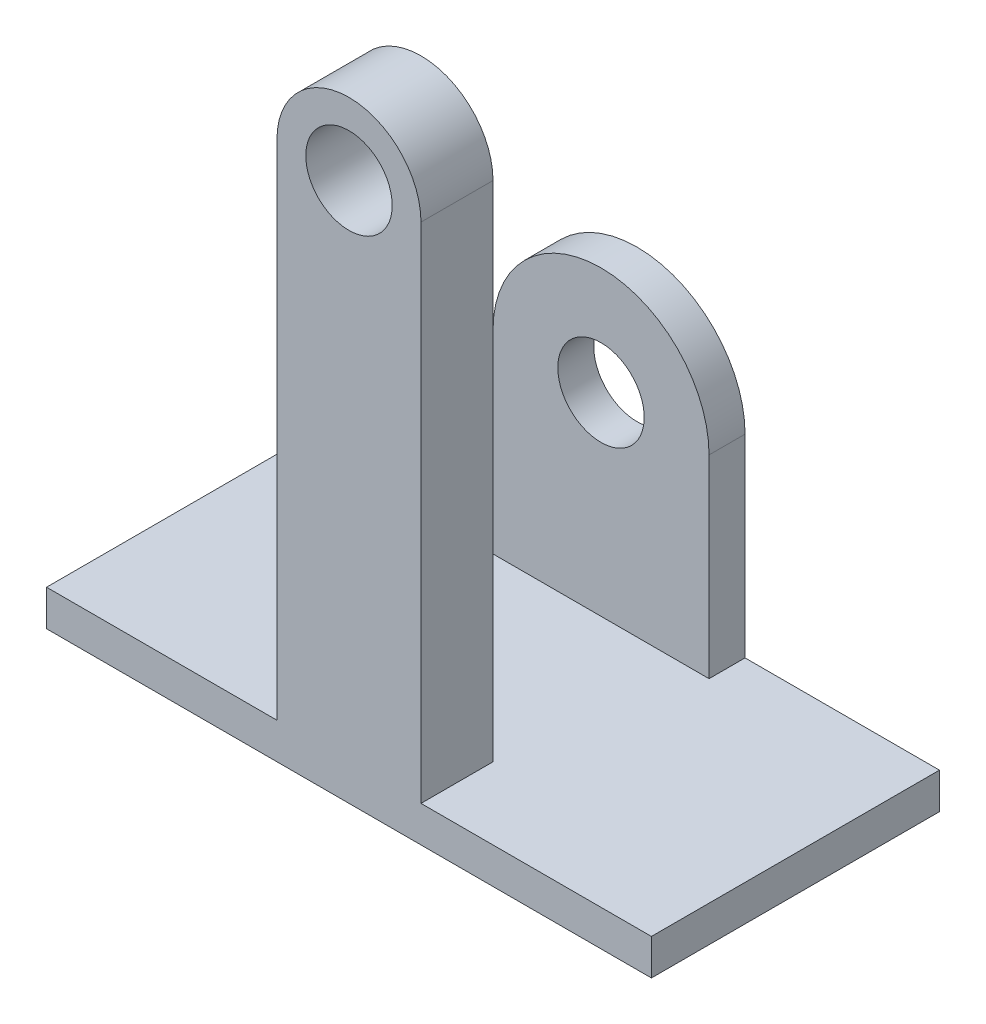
from build123d import *

# Parameters (mm, degrees)
ESQUISSE1_R      = 10
ESQUISSE1_R_2    = 6
EXTRUSION1_DEPTH = 10
EXTRUSION2_START = -10
EXTRUSION2_DEPTH = 10
ESQUISSE3_W      = 84
ESQUISSE3_H      = 5
EXTRUSION3_DEPTH = 40
ESQUISSE4_R      = 6
EXTRUSION4_DEPTH = 5


with BuildPart() as part:
    # Esquisse1 → Extrusion1 (new body)
    with BuildSketch(Plane.XY):
        Circle(ESQUISSE1_R)
        Circle(ESQUISSE1_R_2, mode=Mode.SUBTRACT)
    extrude(amount=EXTRUSION1_DEPTH)

    # Esquisse2 → Extrusion2 (add)
    with BuildSketch(Plane.XY.offset(10).offset(EXTRUSION2_START)):
        with BuildLine():
            Line((-10, 0), (-10, -70))
            Line((-10, -70), (10, -70))
            Line((10, -70), (10, 0))
            ThreePointArc((10, 0), (0, -10), (-10, 0))
        make_face()
    extrude(amount=EXTRUSION2_DEPTH)

    # Esquisse3 → Extrusion3 (add)
    with BuildSketch(Plane.XY.offset(10)):
        with Locations((0, -72.411627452)):
            Rectangle(ESQUISSE3_W, ESQUISSE3_H)
    extrude(amount=-EXTRUSION3_DEPTH)

    # Esquisse4 → Extrusion4 (add)
    with BuildSketch(Plane(origin=(0, 0, -30), x_dir=(-1, 0, 0), z_dir=(0, 0, -1))):
        with BuildLine():
            Line((-15.003732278, -43), (-15.003732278, -74.911627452))
            Line((-15.003732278, -74.911627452), (14.996267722, -74.911627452))
            Line((14.996267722, -74.911627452), (14.996267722, -43))
            ThreePointArc((14.996267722, -43), (-0.003732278, -28), (-15.003732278, -43))
        make_face()
        with Locations((0, -43)):
            Circle(ESQUISSE4_R, mode=Mode.SUBTRACT)
    extrude(amount=-EXTRUSION4_DEPTH)


solid = part.part
